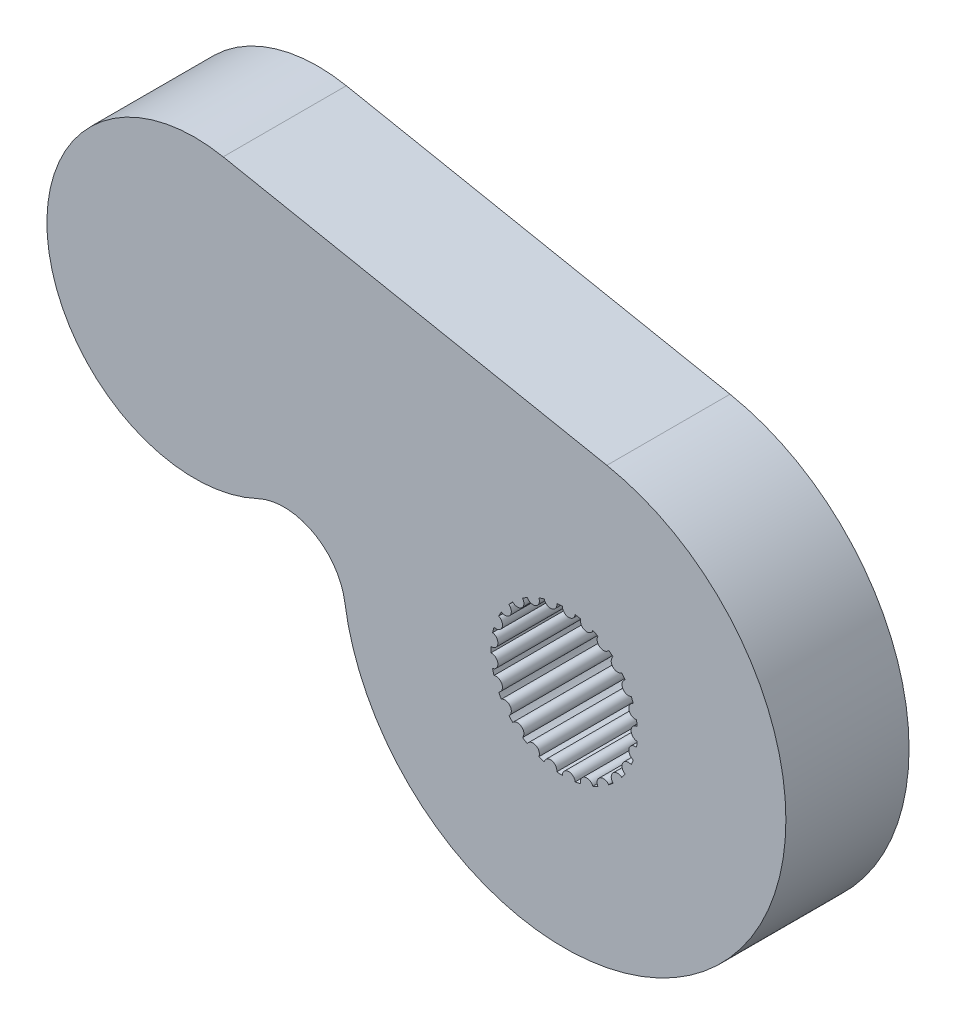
from build123d import *

# Parameters (mm, degrees)
ESQUISSE1_R        = 2.975
BOSS_EXTRU_1_DEPTH = 5
ESQUISSE4_R        = 0.26
BOSS_EXTRU_3_DEPTH = 5


with BuildPart() as part:
    # Esquisse1 → Boss.-Extru.1 (new body)
    with BuildSketch(Plane.XY):
        with BuildLine():
            Line((-13.844895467, 11.887761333), (1.7326568, 8.831642))
            ThreePointArc((1.7326568, 8.831642), (6.214704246, -6.509796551), (-8.902467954, -1.321387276))
            ThreePointArc((-8.902467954, -1.321387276), (-10.195608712, 0.5156818), (-12.441441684, 0.572866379))
            ThreePointArc((-12.441441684, 0.572866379), (-20.954371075, 5.261443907), (-13.844895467, 11.887761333))
        make_face()
        Circle(ESQUISSE1_R, mode=Mode.SUBTRACT)
    extrude(amount=BOSS_EXTRU_1_DEPTH)

    # Esquisse4 → Boss.-Extru.3 (add)
    with BuildSketch(Plane.XY.offset(5)):
        with Locations((2.975, 0)):
            Circle(ESQUISSE4_R)
        with Locations((2.881534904, -0.739852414)):
            Circle(ESQUISSE4_R)
        with Locations((2.607012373, -1.43321718)):
            Circle(ESQUISSE4_R)
        with Locations((2.168681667, -2.03652764)):
            Circle(ESQUISSE4_R)
        with Locations((1.594084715, -2.511875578)):
            Circle(ESQUISSE4_R)
        with Locations((0.919325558, -2.829393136)):
            Circle(ESQUISSE4_R)
        with Locations((0.186801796, -2.969129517)):
            Circle(ESQUISSE4_R)
        with Locations((-0.557459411, -2.922304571)):
            Circle(ESQUISSE4_R)
        with Locations((-1.266693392, -2.691860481)):
            Circle(ESQUISSE4_R)
        with Locations((-1.89633637, -2.292276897)):
            Circle(ESQUISSE4_R)
        with Locations((-2.406825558, -1.748661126)):
            Circle(ESQUISSE4_R)
        with Locations((-2.766085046, -1.095170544)):
            Circle(ESQUISSE4_R)
        with Locations((-2.951541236, -0.37286637)):
            Circle(ESQUISSE4_R)
        with Locations((-2.951541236, 0.37286637)):
            Circle(ESQUISSE4_R)
        with Locations((-2.766085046, 1.095170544)):
            Circle(ESQUISSE4_R)
        with Locations((-2.406825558, 1.748661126)):
            Circle(ESQUISSE4_R)
        with Locations((-1.89633637, 2.292276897)):
            Circle(ESQUISSE4_R)
        with Locations((-1.266693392, 2.691860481)):
            Circle(ESQUISSE4_R)
        with Locations((-0.557459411, 2.922304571)):
            Circle(ESQUISSE4_R)
        with Locations((0.186801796, 2.969129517)):
            Circle(ESQUISSE4_R)
        with Locations((0.919325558, 2.829393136)):
            Circle(ESQUISSE4_R)
        with Locations((1.594084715, 2.511875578)):
            Circle(ESQUISSE4_R)
        with Locations((2.168681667, 2.03652764)):
            Circle(ESQUISSE4_R)
        with Locations((2.607012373, 1.43321718)):
            Circle(ESQUISSE4_R)
        with Locations((2.881534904, 0.739852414)):
            Circle(ESQUISSE4_R)
    extrude(amount=-BOSS_EXTRU_3_DEPTH)


solid = part.part
